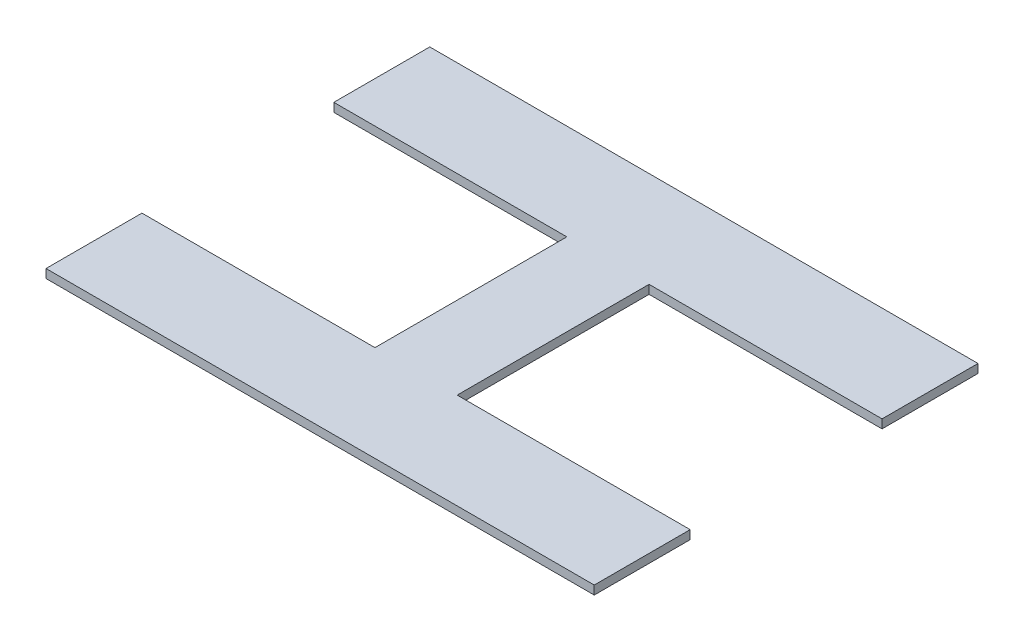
from build123d import *

# Parameters (mm, degrees)
SKETCH1_W           = 200
SKETCH1_H           = 140
BOSS_EXTRUDE1_DEPTH = 3.175
SKETCH2_W           = 85
SKETCH2_H           = 70
CUT_EXTRUDE1_DEPTH  = 245.151757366


with BuildPart() as part:
    # Sketch1 → Boss-Extrude1 (new body)
    with BuildSketch(Plane(origin=(0, 0, 0), x_dir=(1, 0, 0), z_dir=(0, 1, 0))):
        with Locations((100, 70)):
            Rectangle(SKETCH1_W, SKETCH1_H)
    extrude(amount=BOSS_EXTRUDE1_DEPTH)

    # Sketch2 → Cut-Extrude1 (cut, through all)
    with BuildSketch(Plane(origin=(0, 3.175, 0), x_dir=(1, 0, 0), z_dir=(0, 1, 0))):
        with Locations((42.5, 70)):
            Rectangle(SKETCH2_W, SKETCH2_H)
        with Locations((157.5, 70)):
            Rectangle(SKETCH2_W, SKETCH2_H)
    extrude(amount=-CUT_EXTRUDE1_DEPTH, mode=Mode.SUBTRACT)


solid = part.part
